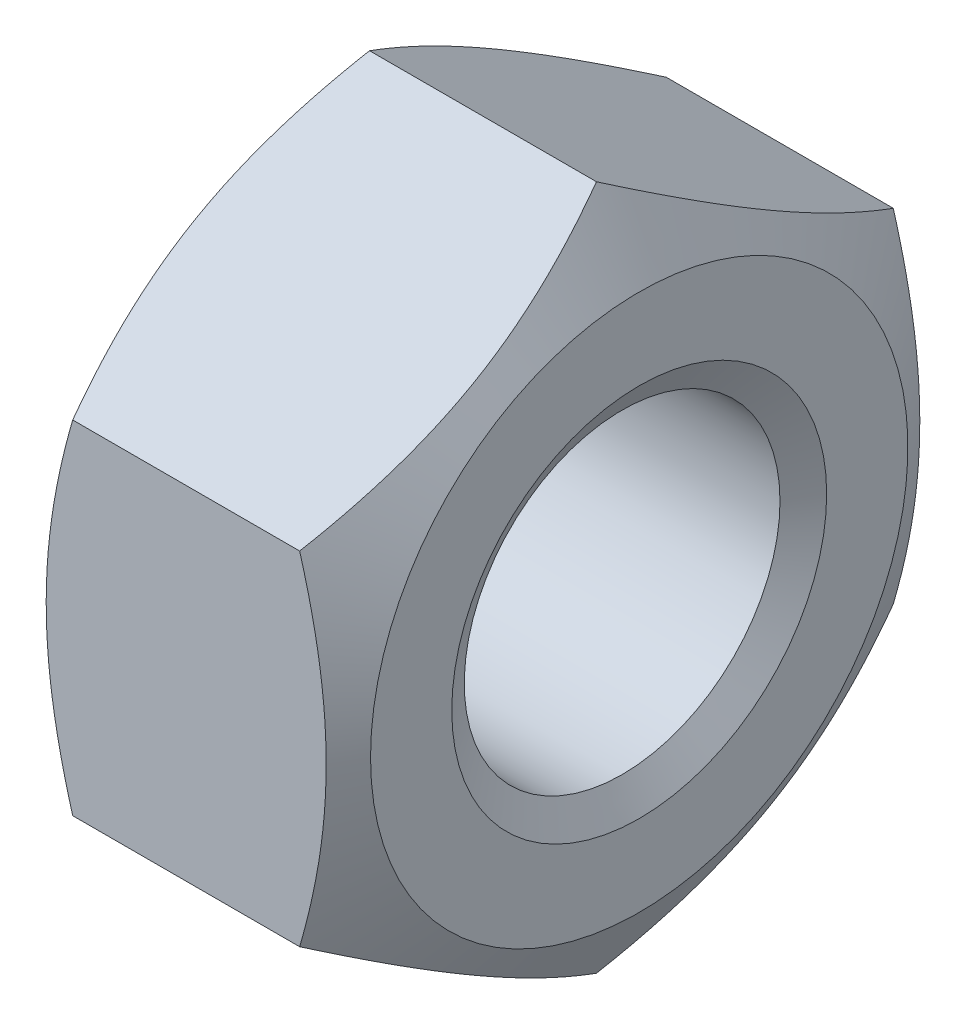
ISO-10303-21;
HEADER;
FILE_DESCRIPTION(('STEP AP214'),'2;1');
FILE_NAME('part.step','',(''),(''),'','','');
FILE_SCHEMA(('AUTOMOTIVE_DESIGN { 1 0 10303 214 1 1 1 1 }'));
ENDSEC;
DATA;
#1=APPLICATION_CONTEXT('core data for automotive mechanical design processes');
#2=APPLICATION_PROTOCOL_DEFINITION('international standard','automotive_design',2000,#1);
#3=PRODUCT_CONTEXT('',#1,'mechanical');
#4=PRODUCT('Part','Part','',(#3));
#5=PRODUCT_RELATED_PRODUCT_CATEGORY('part','',(#4));
#6=PRODUCT_DEFINITION_FORMATION('','',#4);
#7=PRODUCT_DEFINITION_CONTEXT('part definition',#1,'design');
#8=PRODUCT_DEFINITION('design','',#6,#7);
#9=PRODUCT_DEFINITION_SHAPE('','',#8);
#10=(LENGTH_UNIT() NAMED_UNIT(*) SI_UNIT(.MILLI.,.METRE.));
#11=(NAMED_UNIT(*) PLANE_ANGLE_UNIT() SI_UNIT($,.RADIAN.));
#12=(NAMED_UNIT(*) SI_UNIT($,.STERADIAN.) SOLID_ANGLE_UNIT());
#13=UNCERTAINTY_MEASURE_WITH_UNIT(LENGTH_MEASURE(1.E-05),#10,'distance_accuracy_value','');
#14=(GEOMETRIC_REPRESENTATION_CONTEXT(3) GLOBAL_UNCERTAINTY_ASSIGNED_CONTEXT((#13)) GLOBAL_UNIT_ASSIGNED_CONTEXT((#10,
#11,#12)) REPRESENTATION_CONTEXT('',''));
#15=CARTESIAN_POINT('',(0.,0.,0.));
#16=DIRECTION('',(0.,0.,1.));
#17=DIRECTION('',(1.,0.,0.));
#18=AXIS2_PLACEMENT_3D('',#15,#16,#17);
#19=CARTESIAN_POINT('',(0.,-5.48482755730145,9.5));
#20=DIRECTION('',(0.,0.,1.));
#21=DIRECTION('',(1.,0.,0.));
#22=AXIS2_PLACEMENT_3D('',#19,#20,#21);
#23=PLANE('',#22);
#24=CARTESIAN_POINT('',(8.63187894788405,5.48482758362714,9.49999996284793));
#25=CARTESIAN_POINT('',(8.70147520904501,5.24369252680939,9.49999998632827));
#26=CARTESIAN_POINT('',(8.76791252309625,5.00165839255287,9.49999999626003));
#27=CARTESIAN_POINT('',(8.89359278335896,4.51564921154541,9.50000000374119));
#28=CARTESIAN_POINT('',(8.95283336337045,4.27167355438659,9.50000000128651));
#29=CARTESIAN_POINT('',(9.11861349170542,3.53581558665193,9.49999999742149));
#30=CARTESIAN_POINT('',(9.21290737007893,3.0410284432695,9.49999999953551));
#31=CARTESIAN_POINT('',(9.32347378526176,2.3006021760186,9.50000000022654));
#32=CARTESIAN_POINT('',(9.35496961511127,2.05717497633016,9.5000000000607));
#33=CARTESIAN_POINT('',(9.40778517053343,1.56919363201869,9.4999999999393));
#34=CARTESIAN_POINT('',(9.42910470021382,1.32463946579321,9.49999999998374));
#35=CARTESIAN_POINT('',(9.46102139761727,0.835123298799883,9.50000000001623));
#36=CARTESIAN_POINT('',(9.47163130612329,0.590162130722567,9.50000000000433));
#37=CARTESIAN_POINT('',(9.48190331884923,0.10001365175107,9.49999999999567));
#38=CARTESIAN_POINT('',(9.48156576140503,-0.14517365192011,9.49999999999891));
#39=CARTESIAN_POINT('',(9.47070520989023,-0.603542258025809,9.50000000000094));
#40=CARTESIAN_POINT('',(9.46150706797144,-0.816755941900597,9.50000000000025));
#41=CARTESIAN_POINT('',(9.43501079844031,-1.24268462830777,9.49999999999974));
#42=CARTESIAN_POINT('',(9.41771209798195,-1.45539959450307,9.49999999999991));
#43=CARTESIAN_POINT('',(9.35407408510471,-2.09272023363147,9.50000000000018));
#44=CARTESIAN_POINT('',(9.29600079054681,-2.51619784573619,9.50000000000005));
#45=CARTESIAN_POINT('',(9.1508195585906,-3.36764455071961,9.49999999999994));
#46=CARTESIAN_POINT('',(9.06309632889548,-3.79550500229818,9.49999999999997));
#47=CARTESIAN_POINT('',(8.86400199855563,-4.64484614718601,9.50000000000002));
#48=CARTESIAN_POINT('',(8.75267764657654,-5.06633771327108,9.50000000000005));
#49=CARTESIAN_POINT('',(8.6318790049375,-5.48482747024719,9.5));
#50=B_SPLINE_CURVE_WITH_KNOTS('',3,(#24,#25,#26,#27,#28,#29,#30,#31,#32,#33,#34,#35,#36,#37,#38,
#39,#40,#41,#42,#43,#44,#45,#46,#47,#48,#49),.UNSPECIFIED.,.F.,.F.,(4,2,2,2,2,2,2,2,2,2,2,2,4),
(0.,0.752872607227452,1.5059920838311,3.01543666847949,3.75163418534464,4.48784587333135,
5.2231806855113,5.95849277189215,6.59856926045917,7.23869102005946,8.51984395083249,
9.82940671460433,11.136399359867),.UNSPECIFIED.);
#51=CARTESIAN_POINT('',(8.63187899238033,5.48482757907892,9.4999999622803));
#52=VERTEX_POINT('',#51);
#53=CARTESIAN_POINT('',(8.63187899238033,-5.4848275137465,9.5));
#54=VERTEX_POINT('',#53);
#55=EDGE_CURVE('E91',#52,#54,#50,.T.);
#56=ORIENTED_EDGE('',*,*,#55,.F.);
#57=DIRECTION('',(1.,0.,0.));
#58=VECTOR('',#57,1.);
#59=CARTESIAN_POINT('',(0.,5.48482755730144,9.49999999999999));
#60=LINE('',#59,#58);
#61=CARTESIAN_POINT('',(1.36812100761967,5.4848275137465,9.49999999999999));
#62=VERTEX_POINT('',#61);
#63=EDGE_CURVE('E79',#62,#52,#60,.T.);
#64=ORIENTED_EDGE('',*,*,#63,.F.);
#65=CARTESIAN_POINT('',(1.36812099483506,-5.48482747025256,9.50000000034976));
#66=CARTESIAN_POINT('',(1.29852474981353,-5.24369241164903,9.50000000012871));
#67=CARTESIAN_POINT('',(1.23208744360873,-5.00165827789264,9.50000000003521));
#68=CARTESIAN_POINT('',(1.10640719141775,-4.51564909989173,9.49999999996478));
#69=CARTESIAN_POINT('',(1.0471666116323,-4.27167344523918,9.49999999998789));
#70=CARTESIAN_POINT('',(0.881386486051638,-3.53581548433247,9.50000000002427));
#71=CARTESIAN_POINT('',(0.787092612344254,-3.04102834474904,9.50000000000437));
#72=CARTESIAN_POINT('',(0.676526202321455,-2.30060208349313,9.49999999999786));
#73=CARTESIAN_POINT('',(0.64503037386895,-2.05717488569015,9.49999999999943));
#74=CARTESIAN_POINT('',(0.59221482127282,-1.56919354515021,9.50000000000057));
#75=CARTESIAN_POINT('',(0.570895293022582,-1.32463938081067,9.50000000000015));
#76=CARTESIAN_POINT('',(0.538978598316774,-0.835123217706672,9.49999999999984));
#77=CARTESIAN_POINT('',(0.528368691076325,-0.590162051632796,9.49999999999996));
#78=CARTESIAN_POINT('',(0.518096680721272,-0.100013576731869,9.50000000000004));
#79=CARTESIAN_POINT('',(0.518434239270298,0.145173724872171,9.50000000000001));
#80=CARTESIAN_POINT('',(0.529294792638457,0.603542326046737,9.49999999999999));
#81=CARTESIAN_POINT('',(0.538492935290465,0.816756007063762,9.49999999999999));
#82=CARTESIAN_POINT('',(0.564989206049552,1.24268468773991,9.5));
#83=CARTESIAN_POINT('',(0.582287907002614,1.45539965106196,9.5));
#84=CARTESIAN_POINT('',(0.6459259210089,2.09272028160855,9.49999999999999));
#85=CARTESIAN_POINT('',(0.703999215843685,2.51619788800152,9.5));
#86=CARTESIAN_POINT('',(0.849180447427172,3.36764458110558,9.5));
#87=CARTESIAN_POINT('',(0.936903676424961,3.79550502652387,9.5));
#88=CARTESIAN_POINT('',(1.13599800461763,4.64484615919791,9.5));
#89=CARTESIAN_POINT('',(1.24732235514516,5.06633771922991,9.5));
#90=CARTESIAN_POINT('',(1.3681209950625,5.48482747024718,9.5));
#91=B_SPLINE_CURVE_WITH_KNOTS('',3,(#65,#66,#67,#68,#69,#70,#71,#72,#73,#74,#75,#76,#77,#78,#79,
#80,#81,#82,#83,#84,#85,#86,#87,#88,#89,#90),.UNSPECIFIED.,.F.,.F.,(4,2,2,2,2,2,2,2,2,2,2,2,4),
(0.,0.752872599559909,1.50599206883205,3.01543663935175,3.75163415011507,4.48784583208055,
5.22318063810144,5.95849271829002,6.59856919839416,7.23869094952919,8.51984386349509,
9.82940660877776,11.1363992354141),.UNSPECIFIED.);
#92=CARTESIAN_POINT('',(1.3681210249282,-5.48482754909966,9.50000001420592));
#93=VERTEX_POINT('',#92);
#94=EDGE_CURVE('E115',#93,#62,#91,.T.);
#95=ORIENTED_EDGE('',*,*,#94,.F.);
#96=DIRECTION('',(1.,0.,0.));
#97=VECTOR('',#96,1.);
#98=CARTESIAN_POINT('',(0.,-5.48482755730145,9.5));
#99=LINE('',#98,#97);
#100=EDGE_CURVE('E94',#54,#93,#99,.F.);
#101=ORIENTED_EDGE('',*,*,#100,.F.);
#102=EDGE_LOOP('',(#56,#64,#95,#101));
#103=FACE_BOUND('',#102,.T.);
#104=ADVANCED_FACE('F15',(#103),#23,.T.);
#105=CARTESIAN_POINT('',(0.,5.48482755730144,9.5));
#106=DIRECTION('',(0.,0.866025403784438,0.500000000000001));
#107=DIRECTION('',(0.,-0.500000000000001,0.866025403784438));
#108=AXIS2_PLACEMENT_3D('',#105,#106,#107);
#109=PLANE('',#108);
#110=CARTESIAN_POINT('',(8.63187900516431,10.9696550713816,7.55601558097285E-08));
#111=CARTESIAN_POINT('',(8.70147525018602,10.8490875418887,0.208829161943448));
#112=CARTESIAN_POINT('',(8.7679125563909,10.7280704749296,0.41843687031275));
#113=CARTESIAN_POINT('',(8.89359280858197,10.4850658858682,0.839333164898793));
#114=CARTESIAN_POINT('',(8.95283338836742,10.3630780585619,1.0506222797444));
#115=CARTESIAN_POINT('',(9.11861351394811,9.99514907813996,1.68789396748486));
#116=CARTESIAN_POINT('',(9.21290738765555,9.74775550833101,2.11639219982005));
#117=CARTESIAN_POINT('',(9.32347379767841,9.37754237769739,2.75762015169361));
#118=CARTESIAN_POINT('',(9.35496962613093,9.25582877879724,2.96843428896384));
#119=CARTESIAN_POINT('',(9.40778517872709,9.01183810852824,3.39103852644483));
#120=CARTESIAN_POINT('',(9.42910470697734,8.8895610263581,3.60282864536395));
#121=CARTESIAN_POINT('',(9.46102140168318,8.64480294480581,4.02676207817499));
#122=CARTESIAN_POINT('',(9.47163130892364,8.52232236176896,4.2389046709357));
#123=CARTESIAN_POINT('',(9.48190331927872,8.27724812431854,4.66338570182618));
#124=CARTESIAN_POINT('',(9.48156576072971,8.15465447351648,4.87572413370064));
#125=CARTESIAN_POINT('',(9.47070520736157,7.92547017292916,5.27268298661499));
#126=CARTESIAN_POINT('',(9.46150706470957,7.81886333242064,5.45733145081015));
#127=CARTESIAN_POINT('',(9.43501079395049,7.60589899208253,5.82619650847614));
#128=CARTESIAN_POINT('',(9.41771209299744,7.49954151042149,6.01041307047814));
#129=CARTESIAN_POINT('',(9.35407407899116,7.18088119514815,6.56234892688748));
#130=CARTESIAN_POINT('',(9.29600078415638,6.96914239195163,6.92909129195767));
#131=CARTESIAN_POINT('',(9.15081955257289,6.54341904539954,7.66646575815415));
#132=CARTESIAN_POINT('',(9.0630963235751,6.32948882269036,8.03700377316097));
#133=CARTESIAN_POINT('',(8.8640019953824,5.90481825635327,8.77255477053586));
#134=CARTESIAN_POINT('',(8.75267764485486,5.69407247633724,9.13757716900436));
#135=CARTESIAN_POINT('',(8.63187900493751,5.48482760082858,9.49999992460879));
#136=B_SPLINE_CURVE_WITH_KNOTS('',3,(#110,#111,#112,#113,#114,#115,#116,#117,#118,#119,#120,
#121,#122,#123,#124,#125,#126,#127,#128,#129,#130,#131,#132,#133,#134,#135),.UNSPECIFIED.,.F.,
.F.,(4,2,2,2,2,2,2,2,2,2,2,2,4),(0.,0.752872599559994,1.50599206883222,3.01543663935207,
3.75163415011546,4.48784583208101,5.22318063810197,5.95849271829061,6.59856919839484,
7.23869094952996,8.51984386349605,9.82940660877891,11.1363992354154),.UNSPECIFIED.);
#137=CARTESIAN_POINT('',(8.63187897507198,10.9696551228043,1.42053495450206E-08));
#138=VERTEX_POINT('',#137);
#139=EDGE_CURVE('E19',#138,#52,#136,.T.);
#140=ORIENTED_EDGE('',*,*,#139,.F.);
#141=DIRECTION('',(1.,0.,0.));
#142=VECTOR('',#141,1.);
#143=CARTESIAN_POINT('',(0.,10.9696551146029,0.));
#144=LINE('',#143,#142);
#145=CARTESIAN_POINT('',(1.36812100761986,10.9696550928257,3.77191264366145E-08));
#146=VERTEX_POINT('',#145);
#147=EDGE_CURVE('E72',#146,#138,#144,.T.);
#148=ORIENTED_EDGE('',*,*,#147,.F.);
#149=CARTESIAN_POINT('',(1.36812105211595,5.48482751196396,9.50000000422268));
#150=CARTESIAN_POINT('',(1.29852479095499,5.60539506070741,9.29117093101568));
#151=CARTESIAN_POINT('',(1.23208747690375,5.72641213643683,9.08156322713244));
#152=CARTESIAN_POINT('',(1.10640721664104,5.96941673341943,8.66066693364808));
#153=CARTESIAN_POINT('',(1.04716663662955,6.09140455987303,8.44937781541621));
#154=CARTESIAN_POINT('',(0.881386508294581,6.45933354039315,7.81210611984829));
#155=CARTESIAN_POINT('',(0.787092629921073,6.70672711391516,7.38360788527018));
#156=CARTESIAN_POINT('',(0.676526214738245,7.07694024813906,6.74237992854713));
#157=CARTESIAN_POINT('',(0.645030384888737,7.19865384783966,6.53156578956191));
#158=CARTESIAN_POINT('',(0.592214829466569,7.44264451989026,6.1089615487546));
#159=CARTESIAN_POINT('',(0.570895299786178,7.56492160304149,5.89717142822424));
#160=CARTESIAN_POINT('',(0.538978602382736,7.80967968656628,5.47323799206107));
#161=CARTESIAN_POINT('',(0.528368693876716,7.93216027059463,5.26109539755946));
#162=CARTESIAN_POINT('',(0.518096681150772,8.17723451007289,4.83661436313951));
#163=CARTESIAN_POINT('',(0.518434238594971,8.29982816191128,4.62427592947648));
#164=CARTESIAN_POINT('',(0.529294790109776,8.52901246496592,4.22731707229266));
#165=CARTESIAN_POINT('',(0.538492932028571,8.63561930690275,4.04266860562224));
#166=CARTESIAN_POINT('',(0.56498920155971,8.84858365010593,3.67380354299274));
#167=CARTESIAN_POINT('',(0.582287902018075,8.95494113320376,3.4895869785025));
#168=CARTESIAN_POINT('',(0.645925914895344,9.27360145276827,2.93765111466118));
#169=CARTESIAN_POINT('',(0.703999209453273,9.48534025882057,2.57090874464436));
#170=CARTESIAN_POINT('',(0.849180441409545,9.91106361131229,1.83353426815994));
#171=CARTESIAN_POINT('',(0.936903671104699,10.1249938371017,1.46299624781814));
#172=CARTESIAN_POINT('',(1.13599800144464,10.5496644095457,0.727445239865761));
#173=CARTESIAN_POINT('',(1.24732235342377,10.7604101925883,0.362422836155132));
#174=CARTESIAN_POINT('',(1.36812099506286,10.9696550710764,7.53901329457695E-08));
#175=B_SPLINE_CURVE_WITH_KNOTS('',3,(#149,#150,#151,#152,#153,#154,#155,#156,#157,#158,#159,
#160,#161,#162,#163,#164,#165,#166,#167,#168,#169,#170,#171,#172,#173,#174),.UNSPECIFIED.,.F.,
.F.,(4,2,2,2,2,2,2,2,2,2,2,2,4),(0.,0.752872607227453,1.5059920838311,3.01543666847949,
3.75163418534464,4.48784587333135,5.2231806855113,5.95849277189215,6.59856926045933,
7.23869102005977,8.51984395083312,9.82940671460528,11.1363993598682),.UNSPECIFIED.);
#176=EDGE_CURVE('E82',#62,#146,#175,.T.);
#177=ORIENTED_EDGE('',*,*,#176,.F.);
#178=ORIENTED_EDGE('',*,*,#63,.T.);
#179=EDGE_LOOP('',(#140,#148,#177,#178));
#180=FACE_BOUND('',#179,.T.);
#181=ADVANCED_FACE('F81',(#180),#109,.T.);
#182=CARTESIAN_POINT('',(0.,10.9696551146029,0.));
#183=DIRECTION('',(0.,0.866025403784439,-0.499999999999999));
#184=DIRECTION('',(0.,0.499999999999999,0.866025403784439));
#185=AXIS2_PLACEMENT_3D('',#182,#183,#184);
#186=PLANE('',#185);
#187=CARTESIAN_POINT('',(8.63187894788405,5.48482751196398,-9.50000000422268));
#188=CARTESIAN_POINT('',(8.70147520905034,5.60539506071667,-9.29117093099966));
#189=CARTESIAN_POINT('',(8.76791252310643,5.7264121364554,-9.0815632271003));
#190=CARTESIAN_POINT('',(8.89359278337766,5.96941673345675,-8.66066693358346));
#191=CARTESIAN_POINT('',(8.95283336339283,6.09140455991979,-8.44937781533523));
#192=CARTESIAN_POINT('',(9.11861349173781,6.45933354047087,-7.81210611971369));
#193=CARTESIAN_POINT('',(9.21290737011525,6.70672711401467,-7.38360788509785));
#194=CARTESIAN_POINT('',(9.32347378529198,7.07694024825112,-6.74237992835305));
#195=CARTESIAN_POINT('',(9.35496961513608,7.19865384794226,-6.53156578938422));
#196=CARTESIAN_POINT('',(9.40778517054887,7.44264451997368,-6.10896154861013));
#197=CARTESIAN_POINT('',(9.42910470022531,7.56492160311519,-5.8971714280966));
#198=CARTESIAN_POINT('',(9.46102139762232,7.80967968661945,-5.473237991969));
#199=CARTESIAN_POINT('',(9.47163130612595,7.93216027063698,-5.26109539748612));
#200=CARTESIAN_POINT('',(9.48190331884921,8.17723451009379,-4.83661436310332));
#201=CARTESIAN_POINT('',(9.48156576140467,8.29982816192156,-4.62427592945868));
#202=CARTESIAN_POINT('',(9.4707052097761,8.52901246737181,-4.22731706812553));
#203=CARTESIAN_POINT('',(9.46150706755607,8.63561931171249,-4.04266859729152));
#204=CARTESIAN_POINT('',(9.43501079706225,8.84858365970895,-3.67380352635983));
#205=CARTESIAN_POINT('',(9.41771209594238,8.95494114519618,-3.48958695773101));
#206=CARTESIAN_POINT('',(9.35407408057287,9.27360147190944,-2.9376510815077));
#207=CARTESIAN_POINT('',(9.29600078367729,9.48534028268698,-2.57090870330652));
#208=CARTESIAN_POINT('',(9.15081954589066,9.91106364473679,-1.83353421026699));
#209=CARTESIAN_POINT('',(9.06309631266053,10.1249938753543,-1.46299618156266));
#210=CARTESIAN_POINT('',(8.86400197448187,10.5496644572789,-0.727445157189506));
#211=CARTESIAN_POINT('',(8.75267761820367,10.7604102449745,-0.362422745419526));
#212=CARTESIAN_POINT('',(8.63187897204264,10.9696551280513,2.3293393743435E-08));
#213=B_SPLINE_CURVE_WITH_KNOTS('',3,(#187,#188,#189,#190,#191,#192,#193,#194,#195,#196,#197,
#198,#199,#200,#201,#202,#203,#204,#205,#206,#207,#208,#209,#210,#211,#212),.UNSPECIFIED.,.F.,
.F.,(4,2,2,2,2,2,2,2,2,2,2,2,4),(0.,0.752872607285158,1.50599208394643,3.01543666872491,
3.75163418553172,4.48784587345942,5.22318068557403,5.95849277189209,6.5985692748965,
7.23869104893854,8.51984400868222,9.82940680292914,11.1363994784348),.UNSPECIFIED.);
#214=CARTESIAN_POINT('',(8.63187899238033,5.48482751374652,-9.5));
#215=VERTEX_POINT('',#214);
#216=EDGE_CURVE('E93',#215,#138,#213,.T.);
#217=ORIENTED_EDGE('',*,*,#216,.F.);
#218=DIRECTION('',(-1.,0.,0.));
#219=VECTOR('',#218,1.);
#220=CARTESIAN_POINT('',(0.,5.48482755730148,-9.5));
#221=LINE('',#220,#219);
#222=CARTESIAN_POINT('',(1.36812100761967,5.48482757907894,-9.4999999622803));
#223=VERTEX_POINT('',#222);
#224=EDGE_CURVE('E188',#223,#215,#221,.F.);
#225=ORIENTED_EDGE('',*,*,#224,.F.);
#226=CARTESIAN_POINT('',(1.36812105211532,10.9696550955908,4.13734741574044E-08));
#227=CARTESIAN_POINT('',(1.29852479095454,10.8490875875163,-0.208829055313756));
#228=CARTESIAN_POINT('',(1.23208747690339,10.7280705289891,-0.4184367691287));
#229=CARTESIAN_POINT('',(1.10640721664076,10.4850659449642,-0.839333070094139));
#230=CARTESIAN_POINT('',(1.04716663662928,10.363078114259,-1.05062218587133));
#231=CARTESIAN_POINT('',(0.88138650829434,9.99514912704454,-1.68789387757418));
#232=CARTESIAN_POINT('',(0.787092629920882,9.74775555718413,-2.11639211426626));
#233=CARTESIAN_POINT('',(0.676526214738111,9.37754242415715,-2.75762007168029));
#234=CARTESIAN_POINT('',(0.645030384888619,9.25582882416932,-2.96843421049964));
#235=CARTESIAN_POINT('',(0.592214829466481,9.01183815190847,-3.39103845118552));
#236=CARTESIAN_POINT('',(0.570895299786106,8.88956106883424,-3.60282857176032));
#237=CARTESIAN_POINT('',(0.538978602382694,8.64480298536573,-4.02676200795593));
#238=CARTESIAN_POINT('',(0.528368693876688,8.52232240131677,-4.23890460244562));
#239=CARTESIAN_POINT('',(0.518096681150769,8.27724816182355,-4.66338563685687));
#240=CARTESIAN_POINT('',(0.518434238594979,8.15465450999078,-4.87572407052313));
#241=CARTESIAN_POINT('',(0.529294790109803,7.92547020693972,-5.27268292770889));
#242=CARTESIAN_POINT('',(0.538492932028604,7.81886336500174,-5.45733139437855));
#243=CARTESIAN_POINT('',(0.564989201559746,7.60589902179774,-5.82619645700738));
#244=CARTESIAN_POINT('',(0.582287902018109,7.49954153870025,-6.01041302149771));
#245=CARTESIAN_POINT('',(0.645925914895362,7.18088121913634,-6.5623488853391));
#246=CARTESIAN_POINT('',(0.703999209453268,6.9691424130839,-6.92909125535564));
#247=CARTESIAN_POINT('',(0.849180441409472,6.54341906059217,-7.66646573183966));
#248=CARTESIAN_POINT('',(0.936903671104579,6.32948883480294,-8.03700375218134));
#249=CARTESIAN_POINT('',(1.13599800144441,5.90481826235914,-8.77255476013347));
#250=CARTESIAN_POINT('',(1.24732235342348,5.69407247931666,-9.13757716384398));
#251=CARTESIAN_POINT('',(1.3681209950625,5.4848276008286,-9.49999992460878));
#252=B_SPLINE_CURVE_WITH_KNOTS('',3,(#226,#227,#228,#229,#230,#231,#232,#233,#234,#235,#236,
#237,#238,#239,#240,#241,#242,#243,#244,#245,#246,#247,#248,#249,#250,#251),.UNSPECIFIED.,.F.,
.F.,(4,2,2,2,2,2,2,2,2,2,2,2,4),(0.,0.752872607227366,1.50599208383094,3.01543666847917,
3.75163418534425,4.48784587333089,5.22318068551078,5.95849277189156,6.59856926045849,
7.23869102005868,8.51984395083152,9.82940671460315,11.1363993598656),.UNSPECIFIED.);
#253=EDGE_CURVE('E158',#146,#223,#252,.T.);
#254=ORIENTED_EDGE('',*,*,#253,.F.);
#255=ORIENTED_EDGE('',*,*,#147,.T.);
#256=EDGE_LOOP('',(#217,#225,#254,#255));
#257=FACE_BOUND('',#256,.T.);
#258=ADVANCED_FACE('F162',(#257),#186,.T.);
#259=CARTESIAN_POINT('',(0.,5.48482755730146,-9.5));
#260=DIRECTION('',(0.,0.,-1.));
#261=DIRECTION('',(-1.,0.,0.));
#262=AXIS2_PLACEMENT_3D('',#259,#260,#261);
#263=PLANE('',#262);
#264=CARTESIAN_POINT('',(8.63187894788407,-5.4848275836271,-9.49999996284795));
#265=CARTESIAN_POINT('',(8.70147520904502,-5.24369252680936,-9.49999998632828));
#266=CARTESIAN_POINT('',(8.76791252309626,-5.00165839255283,-9.49999999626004));
#267=CARTESIAN_POINT('',(8.89359278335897,-4.51564921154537,-9.50000000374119));
#268=CARTESIAN_POINT('',(8.95283336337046,-4.27167355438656,-9.50000000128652));
#269=CARTESIAN_POINT('',(9.11861349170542,-3.5358155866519,-9.49999999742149));
#270=CARTESIAN_POINT('',(9.21290737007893,-3.04102844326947,-9.49999999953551));
#271=CARTESIAN_POINT('',(9.32347378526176,-2.30060217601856,-9.50000000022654));
#272=CARTESIAN_POINT('',(9.35496961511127,-2.05717497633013,-9.5000000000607));
#273=CARTESIAN_POINT('',(9.40778517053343,-1.56919363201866,-9.4999999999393));
#274=CARTESIAN_POINT('',(9.42910470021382,-1.32463946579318,-9.49999999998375));
#275=CARTESIAN_POINT('',(9.46102139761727,-0.835123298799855,-9.50000000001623));
#276=CARTESIAN_POINT('',(9.47163130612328,-0.590162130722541,-9.50000000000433));
#277=CARTESIAN_POINT('',(9.48190331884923,-0.100013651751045,-9.49999999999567));
#278=CARTESIAN_POINT('',(9.48156576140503,0.145173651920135,-9.49999999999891));
#279=CARTESIAN_POINT('',(9.47070520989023,0.603542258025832,-9.50000000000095));
#280=CARTESIAN_POINT('',(9.46150706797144,0.81675594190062,-9.50000000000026));
#281=CARTESIAN_POINT('',(9.43501079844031,1.24268462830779,-9.49999999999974));
#282=CARTESIAN_POINT('',(9.41771209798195,1.45539959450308,-9.49999999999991));
#283=CARTESIAN_POINT('',(9.3540740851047,2.09272023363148,-9.50000000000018));
#284=CARTESIAN_POINT('',(9.2960007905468,2.51619784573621,-9.50000000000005));
#285=CARTESIAN_POINT('',(9.15081955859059,3.36764455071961,-9.49999999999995));
#286=CARTESIAN_POINT('',(9.06309632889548,3.79550500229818,-9.49999999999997));
#287=CARTESIAN_POINT('',(8.86400199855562,4.64484614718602,-9.50000000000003));
#288=CARTESIAN_POINT('',(8.75267764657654,5.06633771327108,-9.50000000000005));
#289=CARTESIAN_POINT('',(8.6318790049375,5.48482747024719,-9.5));
#290=B_SPLINE_CURVE_WITH_KNOTS('',3,(#264,#265,#266,#267,#268,#269,#270,#271,#272,#273,#274,
#275,#276,#277,#278,#279,#280,#281,#282,#283,#284,#285,#286,#287,#288,#289),.UNSPECIFIED.,.F.,
.F.,(4,2,2,2,2,2,2,2,2,2,2,2,4),(0.,0.75287260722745,1.5059920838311,3.01543666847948,
3.75163418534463,4.48784587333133,5.22318068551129,5.95849277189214,6.59856926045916,
7.23869102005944,8.51984395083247,9.82940671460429,11.1363993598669),.UNSPECIFIED.);
#291=CARTESIAN_POINT('',(8.63187899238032,-5.48482757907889,-9.49999996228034));
#292=VERTEX_POINT('',#291);
#293=EDGE_CURVE('E173',#292,#215,#290,.T.);
#294=ORIENTED_EDGE('',*,*,#293,.F.);
#295=DIRECTION('',(1.,0.,0.));
#296=VECTOR('',#295,1.);
#297=CARTESIAN_POINT('',(0.,-5.48482755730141,-9.50000000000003));
#298=LINE('',#297,#296);
#299=CARTESIAN_POINT('',(1.36812100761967,-5.48482751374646,-9.50000000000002));
#300=VERTEX_POINT('',#299);
#301=EDGE_CURVE('E186',#300,#292,#298,.T.);
#302=ORIENTED_EDGE('',*,*,#301,.F.);
#303=CARTESIAN_POINT('',(1.36812105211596,5.48482758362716,-9.49999996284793));
#304=CARTESIAN_POINT('',(1.298524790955,5.24369252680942,-9.49999998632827));
#305=CARTESIAN_POINT('',(1.23208747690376,5.00165839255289,-9.49999999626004));
#306=CARTESIAN_POINT('',(1.10640721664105,4.51564921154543,-9.50000000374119));
#307=CARTESIAN_POINT('',(1.04716663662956,4.27167355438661,-9.50000000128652));
#308=CARTESIAN_POINT('',(0.881386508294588,3.53581558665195,-9.49999999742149));
#309=CARTESIAN_POINT('',(0.787092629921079,3.04102844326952,-9.49999999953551));
#310=CARTESIAN_POINT('',(0.676526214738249,2.30060217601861,-9.50000000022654));
#311=CARTESIAN_POINT('',(0.64503038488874,2.05717497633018,-9.5000000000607));
#312=CARTESIAN_POINT('',(0.592214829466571,1.56919363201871,-9.4999999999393));
#313=CARTESIAN_POINT('',(0.570895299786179,1.32463946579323,-9.49999999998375));
#314=CARTESIAN_POINT('',(0.538978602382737,0.835123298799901,-9.50000000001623));
#315=CARTESIAN_POINT('',(0.528368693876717,0.590162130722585,-9.50000000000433));
#316=CARTESIAN_POINT('',(0.518096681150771,0.100013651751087,-9.49999999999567));
#317=CARTESIAN_POINT('',(0.518434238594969,-0.145173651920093,-9.49999999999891));
#318=CARTESIAN_POINT('',(0.529294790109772,-0.603542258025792,-9.50000000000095));
#319=CARTESIAN_POINT('',(0.538492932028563,-0.816755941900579,-9.50000000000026));
#320=CARTESIAN_POINT('',(0.564989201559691,-1.24268462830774,-9.49999999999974));
#321=CARTESIAN_POINT('',(0.582287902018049,-1.45539959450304,-9.49999999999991));
#322=CARTESIAN_POINT('',(0.645925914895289,-2.09272023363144,-9.50000000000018));
#323=CARTESIAN_POINT('',(0.703999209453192,-2.51619784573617,-9.50000000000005));
#324=CARTESIAN_POINT('',(0.849180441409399,-3.36764455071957,-9.49999999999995));
#325=CARTESIAN_POINT('',(0.936903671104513,-3.79550500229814,-9.49999999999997));
#326=CARTESIAN_POINT('',(1.13599800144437,-4.64484614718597,-9.50000000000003));
#327=CARTESIAN_POINT('',(1.24732235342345,-5.06633771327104,-9.50000000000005));
#328=CARTESIAN_POINT('',(1.36812099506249,-5.48482747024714,-9.5));
#329=B_SPLINE_CURVE_WITH_KNOTS('',3,(#303,#304,#305,#306,#307,#308,#309,#310,#311,#312,#313,
#314,#315,#316,#317,#318,#319,#320,#321,#322,#323,#324,#325,#326,#327,#328),.UNSPECIFIED.,.F.,
.F.,(4,2,2,2,2,2,2,2,2,2,2,2,4),(0.,0.752872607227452,1.5059920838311,3.01543666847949,
3.75163418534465,4.48784587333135,5.22318068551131,5.95849277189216,6.59856926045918,
7.23869102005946,8.51984395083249,9.82940671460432,11.1363993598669),.UNSPECIFIED.);
#330=EDGE_CURVE('E153',#223,#300,#329,.T.);
#331=ORIENTED_EDGE('',*,*,#330,.F.);
#332=ORIENTED_EDGE('',*,*,#224,.T.);
#333=EDGE_LOOP('',(#294,#302,#331,#332));
#334=FACE_BOUND('',#333,.T.);
#335=ADVANCED_FACE('F165',(#334),#263,.T.);
#336=CARTESIAN_POINT('',(0.,-5.48482755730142,-9.50000000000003));
#337=DIRECTION('',(0.,-0.866025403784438,-0.500000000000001));
#338=DIRECTION('',(0.,0.500000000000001,-0.866025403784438));
#339=AXIS2_PLACEMENT_3D('',#336,#337,#338);
#340=PLANE('',#339);
#341=CARTESIAN_POINT('',(8.63187894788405,-10.9696550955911,4.13747505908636E-08));
#342=CARTESIAN_POINT('',(8.70147520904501,-10.8490875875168,-0.208829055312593));
#343=CARTESIAN_POINT('',(8.76791252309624,-10.7280705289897,-0.418436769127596));
#344=CARTESIAN_POINT('',(8.89359278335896,-10.4850659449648,-0.839333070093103));
#345=CARTESIAN_POINT('',(8.95283336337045,-10.3630781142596,-1.05062218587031));
#346=CARTESIAN_POINT('',(9.11861349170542,-9.99514912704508,-1.6878938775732));
#347=CARTESIAN_POINT('',(9.21290737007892,-9.74775555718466,-2.11639211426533));
#348=CARTESIAN_POINT('',(9.32347378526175,-9.37754242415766,-2.75762007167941));
#349=CARTESIAN_POINT('',(9.35496961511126,-9.25582882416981,-2.96843421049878));
#350=CARTESIAN_POINT('',(9.40778517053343,-9.01183815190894,-3.3910384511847));
#351=CARTESIAN_POINT('',(9.42910470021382,-8.88956106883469,-3.60282857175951));
#352=CARTESIAN_POINT('',(9.46102139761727,-8.64480298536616,-4.02676200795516));
#353=CARTESIAN_POINT('',(9.47163130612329,-8.5223224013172,-4.23890460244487));
#354=CARTESIAN_POINT('',(9.48190331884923,-8.27724816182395,-4.66338563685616));
#355=CARTESIAN_POINT('',(9.48156576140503,-8.15465450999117,-4.87572407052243));
#356=CARTESIAN_POINT('',(9.47070520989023,-7.92547020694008,-5.27268292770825));
#357=CARTESIAN_POINT('',(9.46150706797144,-7.81886336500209,-5.45733139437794));
#358=CARTESIAN_POINT('',(9.43501079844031,-7.60589902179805,-5.82619645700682));
#359=CARTESIAN_POINT('',(9.41771209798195,-7.49954153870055,-6.01041302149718));
#360=CARTESIAN_POINT('',(9.35407408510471,-7.18088121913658,-6.56234888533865));
#361=CARTESIAN_POINT('',(9.29600079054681,-6.9691424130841,-6.92909125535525));
#362=CARTESIAN_POINT('',(9.15081955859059,-6.5434190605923,-7.66646573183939));
#363=CARTESIAN_POINT('',(9.06309632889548,-6.32948883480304,-8.03700375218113));
#364=CARTESIAN_POINT('',(8.86400199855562,-5.90481826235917,-8.77255476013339));
#365=CARTESIAN_POINT('',(8.75267764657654,-5.69407247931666,-9.13757716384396));
#366=CARTESIAN_POINT('',(8.6318790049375,-5.48482760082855,-9.49999992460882));
#367=B_SPLINE_CURVE_WITH_KNOTS('',3,(#341,#342,#343,#344,#345,#346,#347,#348,#349,#350,#351,
#352,#353,#354,#355,#356,#357,#358,#359,#360,#361,#362,#363,#364,#365,#366),.UNSPECIFIED.,.F.,
.F.,(4,2,2,2,2,2,2,2,2,2,2,2,4),(0.,0.752872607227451,1.5059920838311,3.01543666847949,
3.75163418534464,4.48784587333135,5.2231806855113,5.95849277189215,6.59856926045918,
7.23869102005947,8.51984395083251,9.82940671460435,11.136399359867),.UNSPECIFIED.);
#368=CARTESIAN_POINT('',(8.63187899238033,-10.9696550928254,3.77196918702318E-08));
#369=VERTEX_POINT('',#368);
#370=EDGE_CURVE('E97',#369,#292,#367,.T.);
#371=ORIENTED_EDGE('',*,*,#370,.F.);
#372=DIRECTION('',(1.,0.,0.));
#373=VECTOR('',#372,1.);
#374=CARTESIAN_POINT('',(0.,-10.9696551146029,0.));
#375=LINE('',#374,#373);
#376=CARTESIAN_POINT('',(1.36812100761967,-10.9696550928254,-3.77196958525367E-08));
#377=VERTEX_POINT('',#376);
#378=EDGE_CURVE('E190',#377,#369,#375,.T.);
#379=ORIENTED_EDGE('',*,*,#378,.F.);
#380=CARTESIAN_POINT('',(1.36812105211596,-5.48482751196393,-9.50000000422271));
#381=CARTESIAN_POINT('',(1.298524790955,-5.60539506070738,-9.29117093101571));
#382=CARTESIAN_POINT('',(1.23208747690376,-5.7264121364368,-9.08156322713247));
#383=CARTESIAN_POINT('',(1.10640721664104,-5.9694167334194,-8.66066693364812));
#384=CARTESIAN_POINT('',(1.04716663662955,-6.091404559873,-8.44937781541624));
#385=CARTESIAN_POINT('',(0.881386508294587,-6.45933354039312,-7.81210611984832));
#386=CARTESIAN_POINT('',(0.787092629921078,-6.70672711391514,-7.38360788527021));
#387=CARTESIAN_POINT('',(0.676526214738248,-7.07694024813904,-6.74237992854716));
#388=CARTESIAN_POINT('',(0.645030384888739,-7.19865384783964,-6.53156578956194));
#389=CARTESIAN_POINT('',(0.59221482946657,-7.44264451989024,-6.10896154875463));
#390=CARTESIAN_POINT('',(0.570895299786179,-7.56492160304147,-5.89717142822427));
#391=CARTESIAN_POINT('',(0.538978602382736,-7.80967968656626,-5.4732379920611));
#392=CARTESIAN_POINT('',(0.528368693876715,-7.93216027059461,-5.26109539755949));
#393=CARTESIAN_POINT('',(0.51809668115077,-8.17723451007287,-4.83661436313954));
#394=CARTESIAN_POINT('',(0.518434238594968,-8.29982816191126,-4.62427592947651));
#395=CARTESIAN_POINT('',(0.529294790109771,-8.52901246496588,-4.22731707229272));
#396=CARTESIAN_POINT('',(0.538492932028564,-8.63561930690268,-4.04266860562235));
#397=CARTESIAN_POINT('',(0.564989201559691,-8.84858365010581,-3.67380354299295));
#398=CARTESIAN_POINT('',(0.582287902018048,-8.95494113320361,-3.48958697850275));
#399=CARTESIAN_POINT('',(0.645925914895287,-9.27360145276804,-2.93765111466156));
#400=CARTESIAN_POINT('',(0.703999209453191,-9.4853402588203,-2.57090874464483));
#401=CARTESIAN_POINT('',(0.849180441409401,-9.91106361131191,-1.83353426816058));
#402=CARTESIAN_POINT('',(0.936903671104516,-10.1249938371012,-1.46299624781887));
#403=CARTESIAN_POINT('',(1.13599800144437,-10.5496644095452,-0.727445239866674));
#404=CARTESIAN_POINT('',(1.24732235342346,-10.7604101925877,-0.362422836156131));
#405=CARTESIAN_POINT('',(1.3681209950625,-10.9696550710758,-7.53912184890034E-08));
#406=B_SPLINE_CURVE_WITH_KNOTS('',3,(#380,#381,#382,#383,#384,#385,#386,#387,#388,#389,#390,
#391,#392,#393,#394,#395,#396,#397,#398,#399,#400,#401,#402,#403,#404,#405),.UNSPECIFIED.,.F.,
.F.,(4,2,2,2,2,2,2,2,2,2,2,2,4),(0.,0.752872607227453,1.5059920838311,3.01543666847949,
3.75163418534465,4.48784587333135,5.22318068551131,5.95849277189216,6.59856926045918,
7.23869102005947,8.51984395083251,9.82940671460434,11.136399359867),.UNSPECIFIED.);
#407=EDGE_CURVE('E39',#300,#377,#406,.T.);
#408=ORIENTED_EDGE('',*,*,#407,.F.);
#409=ORIENTED_EDGE('',*,*,#301,.T.);
#410=EDGE_LOOP('',(#371,#379,#408,#409));
#411=FACE_BOUND('',#410,.T.);
#412=ADVANCED_FACE('F169',(#411),#340,.T.);
#413=CARTESIAN_POINT('',(0.,-10.9696551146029,0.));
#414=DIRECTION('',(0.,-0.866025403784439,0.5));
#415=DIRECTION('',(0.,-0.5,-0.866025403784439));
#416=AXIS2_PLACEMENT_3D('',#413,#414,#415);
#417=PLANE('',#416);
#418=CARTESIAN_POINT('',(8.63187894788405,-5.48482751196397,9.50000000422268));
#419=CARTESIAN_POINT('',(8.70147520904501,-5.60539506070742,9.29117093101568));
#420=CARTESIAN_POINT('',(8.76791252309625,-5.72641213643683,9.08156322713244));
#421=CARTESIAN_POINT('',(8.89359278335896,-5.96941673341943,8.66066693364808));
#422=CARTESIAN_POINT('',(8.95283336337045,-6.09140455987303,8.44937781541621));
#423=CARTESIAN_POINT('',(9.11861349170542,-6.45933354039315,7.81210611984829));
#424=CARTESIAN_POINT('',(9.21290737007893,-6.70672711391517,7.38360788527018));
#425=CARTESIAN_POINT('',(9.32347378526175,-7.07694024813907,6.74237992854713));
#426=CARTESIAN_POINT('',(9.35496961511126,-7.19865384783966,6.53156578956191));
#427=CARTESIAN_POINT('',(9.40778517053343,-7.44264451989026,6.1089615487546));
#428=CARTESIAN_POINT('',(9.42910470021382,-7.56492160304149,5.89717142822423));
#429=CARTESIAN_POINT('',(9.46102139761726,-7.80967968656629,5.47323799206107));
#430=CARTESIAN_POINT('',(9.47163130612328,-7.93216027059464,5.26109539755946));
#431=CARTESIAN_POINT('',(9.48190331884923,-8.17723451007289,4.83661436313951));
#432=CARTESIAN_POINT('',(9.48156576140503,-8.29982816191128,4.62427592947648));
#433=CARTESIAN_POINT('',(9.47070520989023,-8.52901246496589,4.2273170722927));
#434=CARTESIAN_POINT('',(9.46150706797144,-8.63561930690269,4.04266860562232));
#435=CARTESIAN_POINT('',(9.43501079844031,-8.84858365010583,3.67380354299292));
#436=CARTESIAN_POINT('',(9.41771209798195,-8.95494113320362,3.48958697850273));
#437=CARTESIAN_POINT('',(9.35407408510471,-9.27360145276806,2.93765111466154));
#438=CARTESIAN_POINT('',(9.2960007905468,-9.48534025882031,2.57090874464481));
#439=CARTESIAN_POINT('',(9.15081955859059,-9.91106361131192,1.83353426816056));
#440=CARTESIAN_POINT('',(9.06309632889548,-10.1249938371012,1.46299624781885));
#441=CARTESIAN_POINT('',(8.86400199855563,-10.5496644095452,0.727445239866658));
#442=CARTESIAN_POINT('',(8.75267764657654,-10.7604101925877,0.362422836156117));
#443=CARTESIAN_POINT('',(8.6318790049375,-10.9696550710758,7.53912058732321E-08));
#444=B_SPLINE_CURVE_WITH_KNOTS('',3,(#418,#419,#420,#421,#422,#423,#424,#425,#426,#427,#428,
#429,#430,#431,#432,#433,#434,#435,#436,#437,#438,#439,#440,#441,#442,#443),.UNSPECIFIED.,.F.,
.F.,(4,2,2,2,2,2,2,2,2,2,2,2,4),(0.,0.75287260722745,1.5059920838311,3.01543666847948,
3.75163418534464,4.48784587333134,5.22318068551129,5.95849277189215,6.59856926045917,
7.23869102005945,8.51984395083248,9.82940671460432,11.1363993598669),.UNSPECIFIED.);
#445=EDGE_CURVE('E96',#54,#369,#444,.T.);
#446=ORIENTED_EDGE('',*,*,#445,.F.);
#447=ORIENTED_EDGE('',*,*,#100,.T.);
#448=CARTESIAN_POINT('',(1.36812105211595,-10.9696550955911,-4.13747582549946E-08));
#449=CARTESIAN_POINT('',(1.29852479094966,-10.8490875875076,0.208829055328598));
#450=CARTESIAN_POINT('',(1.23208747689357,-10.7280705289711,0.418436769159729));
#451=CARTESIAN_POINT('',(1.10640721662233,-10.4850659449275,0.839333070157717));
#452=CARTESIAN_POINT('',(1.04716663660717,-10.3630781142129,1.05062218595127));
#453=CARTESIAN_POINT('',(0.881386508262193,-9.99514912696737,1.68789387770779));
#454=CARTESIAN_POINT('',(0.787092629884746,-9.74775555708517,2.11639211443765));
#455=CARTESIAN_POINT('',(0.676526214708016,-9.37754242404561,2.75762007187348));
#456=CARTESIAN_POINT('',(0.645030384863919,-9.25582882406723,2.96843421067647));
#457=CARTESIAN_POINT('',(0.592214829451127,-9.01183815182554,3.39103845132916));
#458=CARTESIAN_POINT('',(0.570895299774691,-8.88956106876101,3.60282857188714));
#459=CARTESIAN_POINT('',(0.538978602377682,-8.64480298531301,4.02676200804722));
#460=CARTESIAN_POINT('',(0.528368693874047,-8.52232240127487,4.23890460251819));
#461=CARTESIAN_POINT('',(0.51809668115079,-8.27724816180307,4.66338563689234));
#462=CARTESIAN_POINT('',(0.518434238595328,-8.1546545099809,4.87572407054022));
#463=CARTESIAN_POINT('',(0.529294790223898,-7.92547020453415,5.27268293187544));
#464=CARTESIAN_POINT('',(0.538492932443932,-7.81886336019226,5.45733140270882));
#465=CARTESIAN_POINT('',(0.564989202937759,-7.60589901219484,5.82619647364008));
#466=CARTESIAN_POINT('',(0.582287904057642,-7.49954152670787,6.01041304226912));
#467=CARTESIAN_POINT('',(0.645925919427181,-7.18088119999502,6.56234891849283));
#468=CARTESIAN_POINT('',(0.703999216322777,-6.96914238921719,6.92909129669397));
#469=CARTESIAN_POINT('',(0.849180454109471,-6.54341902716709,7.66646578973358));
#470=CARTESIAN_POINT('',(0.936903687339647,-6.32948879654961,8.03700381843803));
#471=CARTESIAN_POINT('',(1.1359980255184,-5.90481821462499,8.77255484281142));
#472=CARTESIAN_POINT('',(1.24732238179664,-5.69407242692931,9.13757725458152));
#473=CARTESIAN_POINT('',(1.36812102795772,-5.48482754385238,9.50000002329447));
#474=B_SPLINE_CURVE_WITH_KNOTS('',3,(#448,#449,#450,#451,#452,#453,#454,#455,#456,#457,#458,
#459,#460,#461,#462,#463,#464,#465,#466,#467,#468,#469,#470,#471,#472,#473),.UNSPECIFIED.,.F.,
.F.,(4,2,2,2,2,2,2,2,2,2,2,2,4),(0.,0.752872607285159,1.50599208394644,3.01543666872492,
3.75163418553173,4.48784587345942,5.22318068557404,5.95849277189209,6.59856927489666,
7.23869104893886,8.51984400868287,9.82940680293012,11.1363994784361),.UNSPECIFIED.);
#475=EDGE_CURVE('E141',#377,#93,#474,.T.);
#476=ORIENTED_EDGE('',*,*,#475,.F.);
#477=ORIENTED_EDGE('',*,*,#378,.T.);
#478=EDGE_LOOP('',(#446,#447,#476,#477));
#479=FACE_BOUND('',#478,.T.);
#480=ADVANCED_FACE('F209',(#479),#417,.T.);
#481=CARTESIAN_POINT('',(8.62367025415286,0.,0.));
#482=DIRECTION('',(-1.,0.,0.));
#483=DIRECTION('',(0.,0.,1.));
#484=AXIS2_PLACEMENT_3D('',#481,#482,#483);
#485=CONICAL_SURFACE('',#484,10.9838730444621,1.04719755);
#486=CARTESIAN_POINT('',(10.0000000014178,0.,0.));
#487=DIRECTION('',(-1.,0.,0.));
#488=DIRECTION('',(0.,0.,1.));
#489=AXIS2_PLACEMENT_3D('',#486,#487,#488);
#490=CIRCLE('',#489,8.60000000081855);
#491=CARTESIAN_POINT('',(10.0000000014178,0.,8.60000000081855));
#492=VERTEX_POINT('',#491);
#493=EDGE_CURVE('E203',#492,#492,#490,.F.);
#494=ORIENTED_EDGE('',*,*,#493,.F.);
#495=EDGE_LOOP('',(#494));
#496=FACE_BOUND('',#495,.T.);
#497=ORIENTED_EDGE('',*,*,#293,.T.);
#498=ORIENTED_EDGE('',*,*,#216,.T.);
#499=ORIENTED_EDGE('',*,*,#139,.T.);
#500=ORIENTED_EDGE('',*,*,#55,.T.);
#501=ORIENTED_EDGE('',*,*,#445,.T.);
#502=ORIENTED_EDGE('',*,*,#370,.T.);
#503=EDGE_LOOP('',(#497,#498,#499,#500,#501,#502));
#504=FACE_BOUND('',#503,.T.);
#505=ADVANCED_FACE('F89',(#496,#504),#485,.T.);
#506=CARTESIAN_POINT('',(1.37632974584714,0.,0.));
#507=DIRECTION('',(1.,0.,0.));
#508=DIRECTION('',(0.,0.,-1.));
#509=AXIS2_PLACEMENT_3D('',#506,#507,#508);
#510=CONICAL_SURFACE('',#509,10.9838730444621,1.04719755);
#511=CARTESIAN_POINT('',(-1.41776174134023E-09,0.,0.));
#512=DIRECTION('',(1.,0.,0.));
#513=DIRECTION('',(0.,0.,-1.));
#514=AXIS2_PLACEMENT_3D('',#511,#512,#513);
#515=CIRCLE('',#514,8.60000000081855);
#516=CARTESIAN_POINT('',(-1.41776174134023E-09,0.,-8.60000000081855));
#517=VERTEX_POINT('',#516);
#518=EDGE_CURVE('E201',#517,#517,#515,.T.);
#519=ORIENTED_EDGE('',*,*,#518,.T.);
#520=EDGE_LOOP('',(#519));
#521=FACE_BOUND('',#520,.T.);
#522=ORIENTED_EDGE('',*,*,#407,.T.);
#523=ORIENTED_EDGE('',*,*,#475,.T.);
#524=ORIENTED_EDGE('',*,*,#94,.T.);
#525=ORIENTED_EDGE('',*,*,#176,.T.);
#526=ORIENTED_EDGE('',*,*,#253,.T.);
#527=ORIENTED_EDGE('',*,*,#330,.T.);
#528=EDGE_LOOP('',(#522,#523,#524,#525,#526,#527));
#529=FACE_BOUND('',#528,.T.);
#530=ADVANCED_FACE('F129',(#521,#529),#510,.T.);
#531=CARTESIAN_POINT('',(10.,0.,0.));
#532=DIRECTION('',(1.,0.,0.));
#533=DIRECTION('',(0.,0.,-1.));
#534=AXIS2_PLACEMENT_3D('',#531,#532,#533);
#535=PLANE('',#534);
#536=CARTESIAN_POINT('',(10.0000000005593,0.,0.));
#537=DIRECTION('',(1.,0.,0.));
#538=DIRECTION('',(0.,0.,-1.));
#539=AXIS2_PLACEMENT_3D('',#536,#537,#538);
#540=CIRCLE('',#539,6.00021528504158);
#541=CARTESIAN_POINT('',(10.0000000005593,0.,-6.00021528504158));
#542=VERTEX_POINT('',#541);
#543=EDGE_CURVE('E198',#542,#542,#540,.F.);
#544=ORIENTED_EDGE('',*,*,#543,.T.);
#545=EDGE_LOOP('',(#544));
#546=FACE_BOUND('',#545,.T.);
#547=ORIENTED_EDGE('',*,*,#493,.T.);
#548=EDGE_LOOP('',(#547));
#549=FACE_BOUND('',#548,.T.);
#550=ADVANCED_FACE('F133',(#546,#549),#535,.T.);
#551=CARTESIAN_POINT('',(0.,0.,0.));
#552=DIRECTION('',(1.,0.,0.));
#553=DIRECTION('',(0.,0.,-1.));
#554=AXIS2_PLACEMENT_3D('',#551,#552,#553);
#555=PLANE('',#554);
#556=CARTESIAN_POINT('',(-5.20384477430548E-10,0.,0.));
#557=DIRECTION('',(-1.,0.,0.));
#558=DIRECTION('',(0.,0.,1.));
#559=AXIS2_PLACEMENT_3D('',#556,#557,#558);
#560=CIRCLE('',#559,6.00021528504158);
#561=CARTESIAN_POINT('',(-5.20384477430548E-10,0.,6.00021528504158));
#562=VERTEX_POINT('',#561);
#563=EDGE_CURVE('E195',#562,#562,#560,.F.);
#564=ORIENTED_EDGE('',*,*,#563,.T.);
#565=EDGE_LOOP('',(#564));
#566=FACE_BOUND('',#565,.T.);
#567=ORIENTED_EDGE('',*,*,#518,.F.);
#568=EDGE_LOOP('',(#567));
#569=FACE_BOUND('',#568,.T.);
#570=ADVANCED_FACE('F235',(#566,#569),#555,.F.);
#571=CARTESIAN_POINT('',(10.0000000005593,0.,0.));
#572=DIRECTION('',(1.,0.,0.));
#573=DIRECTION('',(0.,0.,-1.));
#574=AXIS2_PLACEMENT_3D('',#571,#572,#573);
#575=CONICAL_SURFACE('',#574,6.00021528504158,1.04719754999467);
#576=ORIENTED_EDGE('',*,*,#543,.F.);
#577=EDGE_LOOP('',(#576));
#578=FACE_BOUND('',#577,.T.);
#579=CARTESIAN_POINT('',(9.45312499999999,0.,0.));
#580=DIRECTION('',(-1.,0.,0.));
#581=DIRECTION('',(0.,-1.,0.));
#582=AXIS2_PLACEMENT_3D('',#579,#580,#581);
#583=CIRCLE('',#582,5.053);
#584=CARTESIAN_POINT('',(9.453125,-5.053,0.));
#585=VERTEX_POINT('',#584);
#586=EDGE_CURVE('E30',#585,#585,#583,.T.);
#587=ORIENTED_EDGE('',*,*,#586,.T.);
#588=EDGE_LOOP('',(#587));
#589=FACE_BOUND('',#588,.T.);
#590=ADVANCED_FACE('F219',(#578,#589),#575,.F.);
#591=CARTESIAN_POINT('',(-4.54747350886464E-10,0.,0.));
#592=DIRECTION('',(-1.,0.,0.));
#593=DIRECTION('',(0.,0.,1.));
#594=AXIS2_PLACEMENT_3D('',#591,#592,#593);
#595=CONICAL_SURFACE('',#594,6.00021528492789,1.04719754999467);
#596=ORIENTED_EDGE('',*,*,#563,.F.);
#597=EDGE_LOOP('',(#596));
#598=FACE_BOUND('',#597,.T.);
#599=CARTESIAN_POINT('',(0.546875,0.,0.));
#600=DIRECTION('',(1.,0.,0.));
#601=DIRECTION('',(0.,0.,-1.));
#602=AXIS2_PLACEMENT_3D('',#599,#600,#601);
#603=CIRCLE('',#602,5.053);
#604=CARTESIAN_POINT('',(0.546875,0.,-5.053));
#605=VERTEX_POINT('',#604);
#606=EDGE_CURVE('E10',#605,#605,#603,.T.);
#607=ORIENTED_EDGE('',*,*,#606,.T.);
#608=EDGE_LOOP('',(#607));
#609=FACE_BOUND('',#608,.T.);
#610=ADVANCED_FACE('F222',(#598,#609),#595,.F.);
#611=CARTESIAN_POINT('',(9.45312499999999,0.,0.));
#612=DIRECTION('',(-1.,0.,0.));
#613=DIRECTION('',(0.,-1.,0.));
#614=AXIS2_PLACEMENT_3D('',#611,#612,#613);
#615=CYLINDRICAL_SURFACE('',#614,5.053);
#616=ORIENTED_EDGE('',*,*,#606,.F.);
#617=EDGE_LOOP('',(#616));
#618=FACE_BOUND('',#617,.T.);
#619=ORIENTED_EDGE('',*,*,#586,.F.);
#620=EDGE_LOOP('',(#619));
#621=FACE_BOUND('',#620,.T.);
#622=ADVANCED_FACE('F17',(#618,#621),#615,.F.);
#623=CLOSED_SHELL('',(#104,#181,#258,#335,#412,#480,#505,#530,#550,#570,#590,#610,#622));
#624=MANIFOLD_SOLID_BREP('B1',#623);
#625=ADVANCED_BREP_SHAPE_REPRESENTATION('',(#18,#624),#14);
#626=SHAPE_DEFINITION_REPRESENTATION(#9,#625);
ENDSEC;
END-ISO-10303-21;
